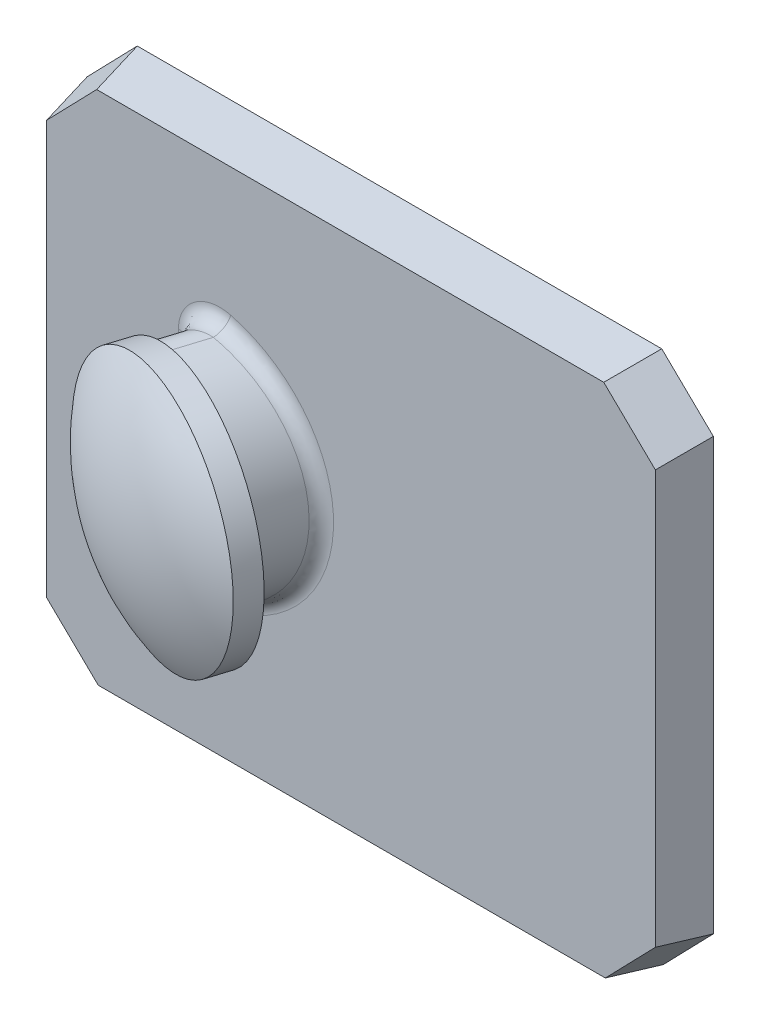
from build123d import *
from OCP.BRepFilletAPI import BRepFilletAPI_MakeChamfer

# Parameters (mm, degrees)
SKETCH1_W      = 12.699
SKETCH1_H      = 10.8
EXTRUDE1_DEPTH = 1
EXTRUDE1_TAPER = 10
EXTRUDE2_REACH = 105.423
FILLET2_R      = 0.3
CHAMFER1_SIZE  = 1
CHAMFER1_SIZE2 = 1.031574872


with BuildPart() as part:
    # Sketch1 → Extrude1 (new body)
    with BuildSketch(Plane.XY):
        with Locations((101.5505, 0)):
            Rectangle(SKETCH1_W, SKETCH1_H)
    extrude(amount=EXTRUDE1_DEPTH, taper=EXTRUDE1_TAPER)

    # Extrude2: up to this plane
    extrude2_end = Plane(origin=(95.201, -5.4, 1), z_dir=(0, 0, -1))
    # Sketch2 → Extrude2 (add, up to the surface)
    with BuildSketch(Plane(origin=(8.326251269, 0, -26.426922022), x_dir=(0.9537803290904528, 0, 0.30050471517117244), z_dir=(-0.30050471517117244, 0, 0.9537803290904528)), mode=Mode.PRIVATE) as extrude2_sk1:
        with BuildLine():
            Line((94.210058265, 1.848172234), (94.210058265, -1.81788696))
            ThreePointArc((94.210058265, -1.81788696), (94.406569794, -2.215246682), (94.841637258, -2.300263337))
            ThreePointArc((94.841637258, -2.300263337), (96.610057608, 0.015142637), (94.841637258, 2.330548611))
            ThreePointArc((94.841637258, 2.330548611), (94.406569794, 2.245531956), (94.210058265, 1.848172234))
        make_face()
    extrude2_tool1 = split(extrude(extrude2_sk1.sketch, amount=-EXTRUDE2_REACH, mode=Mode.PRIVATE), bisect_by=extrude2_end, keep=Keep.BOTH, mode=Mode.PRIVATE)
    add(extrude2_tool1.solids().sort_by_distance((99.168287, 0.015143, 2.194406))[0])

    # Sketch3 → Revolve2 (revolve)
    with BuildSketch(Plane(origin=(0, 0, 0), x_dir=(1, 0, 0), z_dir=(0, 1, 0))):
        with BuildLine():
            Line((99.31173721, -2.157209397), (101.697584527, -2.908912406))
            Line((101.697584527, -2.908912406), (101.547430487, -3.385489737))
            ThreePointArc((101.547430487, -3.385489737), (100.238921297, -3.560859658), (98.935380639, -3.351736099))
            Line((98.935380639, -3.351736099), (99.31173721, -2.157209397))
        make_face()
    revolve(axis=Axis((99.588355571, 0, 1.279244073), (-0.3005051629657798, 0, 0.95378018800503)))

    # Fillet2
    fillet2_edges = [part.edges().sort_by_distance(p)[0] for p in [
        (98.672376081, 2.249826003, 1),
        (98.460358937, 0.015142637, 1),
        (98.672376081, -2.219540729, 1),
        (100.976660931, 0.015142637, 1),
    ]]
    fillet(fillet2_edges, radius=FILLET2_R)

    # Chamfer1: one chamfer whose edges measure the first distance from different faces: ONE call of the kernel's chamfer builder (chamfer() names one face for all edges)
    chamfer1_edges_1 = [part.edges().sort_by_distance(p)[0] for p in [
        (95.289163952, 5.311836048, 0.50000262),
    ]]
    chamfer1_side_1 = [part.faces().sort_by_distance(p)[0] for p in [
        (101.5505, 5.312250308, 0.49765323),
    ]]
    chamfer1_edges_2 = [part.edges().sort_by_distance(p)[0] for p in [
        (107.811836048, 5.311836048, 0.50000262),
    ]]
    chamfer1_side_2 = [part.faces().sort_by_distance(p)[0] for p in [
        (107.812324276, 0, 0.497233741),
    ]]
    chamfer1_edges_3 = [part.edges().sort_by_distance(p)[0] for p in [
        (107.81183651, -5.31183651, 0.5),
    ]]
    chamfer1_side_3 = [part.faces().sort_by_distance(p)[0] for p in [
        (101.5505, -5.312250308, 0.49765323),
    ]]
    chamfer1_edges_4 = [part.edges().sort_by_distance(p)[0] for p in [
        (95.28916349, -5.31183651, 0.5),
    ]]
    chamfer1_side_4 = [part.faces().sort_by_distance(p)[0] for p in [
        (95.288675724, 0, 0.497233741),
    ]]
    chamfer1 = BRepFilletAPI_MakeChamfer(part.part.solid().wrapped)
    for e in chamfer1_edges_1:
        chamfer1.Add(CHAMFER1_SIZE, CHAMFER1_SIZE2, e.wrapped, chamfer1_side_1[0].wrapped)  # the first distance lies on this face
    for e in chamfer1_edges_2:
        chamfer1.Add(CHAMFER1_SIZE, CHAMFER1_SIZE2, e.wrapped, chamfer1_side_2[0].wrapped)  # the first distance lies on this face
    for e in chamfer1_edges_3:
        chamfer1.Add(CHAMFER1_SIZE, CHAMFER1_SIZE2, e.wrapped, chamfer1_side_3[0].wrapped)  # the first distance lies on this face
    for e in chamfer1_edges_4:
        chamfer1.Add(CHAMFER1_SIZE, CHAMFER1_SIZE2, e.wrapped, chamfer1_side_4[0].wrapped)  # the first distance lies on this face
    add(Compound.cast(chamfer1.Shape()), mode=Mode.REPLACE)


solid = part.part
